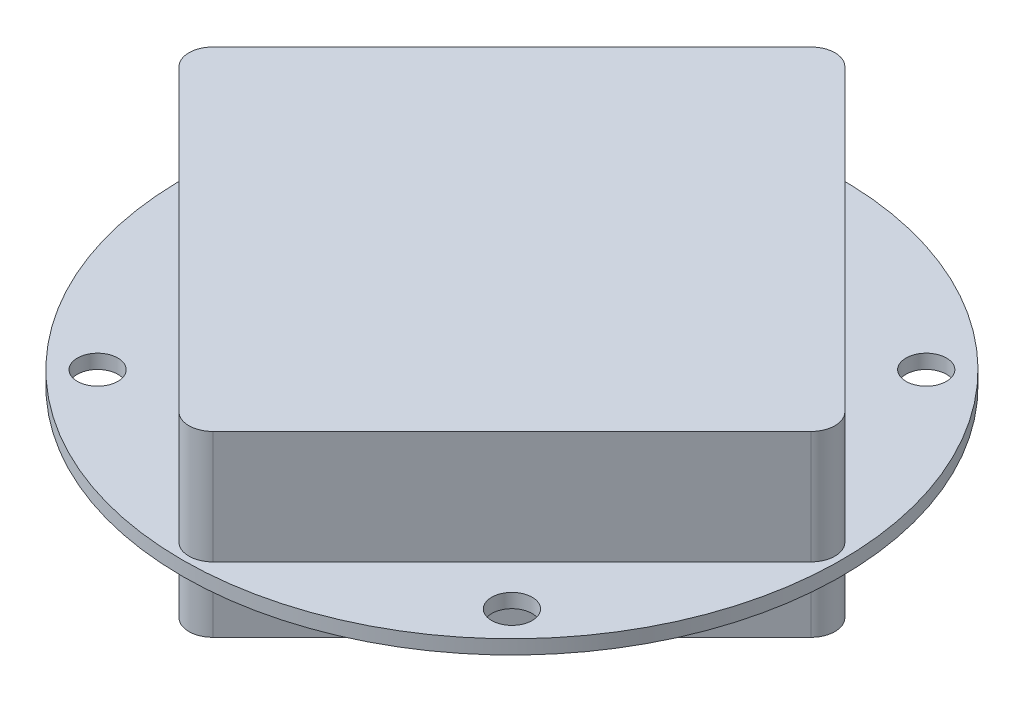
ISO-10303-21;
HEADER;
FILE_DESCRIPTION(('STEP AP214'),'2;1');
FILE_NAME('part.step','',(''),(''),'','','');
FILE_SCHEMA(('AUTOMOTIVE_DESIGN { 1 0 10303 214 1 1 1 1 }'));
ENDSEC;
DATA;
#1=APPLICATION_CONTEXT('core data for automotive mechanical design processes');
#2=APPLICATION_PROTOCOL_DEFINITION('international standard','automotive_design',2000,#1);
#3=PRODUCT_CONTEXT('',#1,'mechanical');
#4=PRODUCT('Part','Part','',(#3));
#5=PRODUCT_RELATED_PRODUCT_CATEGORY('part','',(#4));
#6=PRODUCT_DEFINITION_FORMATION('','',#4);
#7=PRODUCT_DEFINITION_CONTEXT('part definition',#1,'design');
#8=PRODUCT_DEFINITION('design','',#6,#7);
#9=PRODUCT_DEFINITION_SHAPE('','',#8);
#10=(LENGTH_UNIT() NAMED_UNIT(*) SI_UNIT(.MILLI.,.METRE.));
#11=(NAMED_UNIT(*) PLANE_ANGLE_UNIT() SI_UNIT($,.RADIAN.));
#12=(NAMED_UNIT(*) SI_UNIT($,.STERADIAN.) SOLID_ANGLE_UNIT());
#13=UNCERTAINTY_MEASURE_WITH_UNIT(LENGTH_MEASURE(1.E-05),#10,'distance_accuracy_value','');
#14=(GEOMETRIC_REPRESENTATION_CONTEXT(3) GLOBAL_UNCERTAINTY_ASSIGNED_CONTEXT((#13)) GLOBAL_UNIT_ASSIGNED_CONTEXT((#10,
#11,#12)) REPRESENTATION_CONTEXT('',''));
#15=CARTESIAN_POINT('',(0.,0.,0.));
#16=DIRECTION('',(0.,0.,1.));
#17=DIRECTION('',(1.,0.,0.));
#18=AXIS2_PLACEMENT_3D('',#15,#16,#17);
#19=CARTESIAN_POINT('',(0.,0.,0.));
#20=DIRECTION('',(0.,1.,0.));
#21=DIRECTION('',(0.,0.,1.));
#22=AXIS2_PLACEMENT_3D('',#19,#20,#21);
#23=PLANE('',#22);
#24=CARTESIAN_POINT('',(-10.9999999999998,0.,-11.0000000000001));
#25=DIRECTION('',(0.,1.,0.));
#26=DIRECTION('',(0.,0.,1.));
#27=AXIS2_PLACEMENT_3D('',#24,#25,#26);
#28=CIRCLE('',#27,1.075);
#29=CARTESIAN_POINT('',(-10.9999999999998,0.,-9.92500000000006));
#30=VERTEX_POINT('',#29);
#31=EDGE_CURVE('E323',#30,#30,#28,.T.);
#32=ORIENTED_EDGE('',*,*,#31,.T.);
#33=EDGE_LOOP('',(#32));
#34=FACE_BOUND('',#33,.T.);
#35=CARTESIAN_POINT('',(10.9999999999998,0.,-10.9999999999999));
#36=DIRECTION('',(0.,1.,0.));
#37=DIRECTION('',(0.,0.,1.));
#38=AXIS2_PLACEMENT_3D('',#35,#36,#37);
#39=CIRCLE('',#38,1.075);
#40=CARTESIAN_POINT('',(10.9999999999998,0.,-9.92499999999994));
#41=VERTEX_POINT('',#40);
#42=EDGE_CURVE('E317',#41,#41,#39,.T.);
#43=ORIENTED_EDGE('',*,*,#42,.T.);
#44=EDGE_LOOP('',(#43));
#45=FACE_BOUND('',#44,.T.);
#46=CARTESIAN_POINT('',(11.,0.,10.9999999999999));
#47=DIRECTION('',(0.,1.,0.));
#48=DIRECTION('',(0.,0.,1.));
#49=AXIS2_PLACEMENT_3D('',#46,#47,#48);
#50=CIRCLE('',#49,1.075);
#51=CARTESIAN_POINT('',(11.,0.,12.0749999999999));
#52=VERTEX_POINT('',#51);
#53=EDGE_CURVE('E311',#52,#52,#50,.T.);
#54=ORIENTED_EDGE('',*,*,#53,.T.);
#55=EDGE_LOOP('',(#54));
#56=FACE_BOUND('',#55,.T.);
#57=CARTESIAN_POINT('',(-11.,0.,10.9999999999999));
#58=DIRECTION('',(0.,1.,0.));
#59=DIRECTION('',(0.,0.,1.));
#60=AXIS2_PLACEMENT_3D('',#57,#58,#59);
#61=CIRCLE('',#60,1.075);
#62=CARTESIAN_POINT('',(-11.,0.,12.0749999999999));
#63=VERTEX_POINT('',#62);
#64=EDGE_CURVE('E243',#63,#63,#61,.T.);
#65=ORIENTED_EDGE('',*,*,#64,.T.);
#66=EDGE_LOOP('',(#65));
#67=FACE_BOUND('',#66,.T.);
#68=CARTESIAN_POINT('',(0.,0.,0.));
#69=DIRECTION('',(0.,1.,0.));
#70=DIRECTION('',(0.,0.,1.));
#71=AXIS2_PLACEMENT_3D('',#68,#69,#70);
#72=CIRCLE('',#71,17.5);
#73=CARTESIAN_POINT('',(0.,0.,17.5));
#74=VERTEX_POINT('',#73);
#75=EDGE_CURVE('E41',#74,#74,#72,.T.);
#76=ORIENTED_EDGE('',*,*,#75,.F.);
#77=EDGE_LOOP('',(#76));
#78=FACE_BOUND('',#77,.T.);
#79=CARTESIAN_POINT('',(0.,0.,-15.8816183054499));
#80=DIRECTION('',(0.,-1.,0.));
#81=DIRECTION('',(0.,0.,-1.));
#82=AXIS2_PLACEMENT_3D('',#79,#80,#81);
#83=CIRCLE('',#82,1.26999999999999);
#84=CARTESIAN_POINT('',(-0.898025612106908,0.,-16.7796439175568));
#85=VERTEX_POINT('',#84);
#86=CARTESIAN_POINT('',(0.898025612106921,0.,-16.7796439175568));
#87=VERTEX_POINT('',#86);
#88=EDGE_CURVE('E170',#85,#87,#83,.T.);
#89=ORIENTED_EDGE('',*,*,#88,.F.);
#90=DIRECTION('',(0.707106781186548,0.,-0.707106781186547));
#91=VECTOR('',#90,1.);
#92=CARTESIAN_POINT('',(-0.898025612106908,0.,-16.7796439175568));
#93=LINE('',#92,#91);
#94=CARTESIAN_POINT('',(-16.7796439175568,0.,-0.898025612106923));
#95=VERTEX_POINT('',#94);
#96=EDGE_CURVE('E167',#95,#85,#93,.T.);
#97=ORIENTED_EDGE('',*,*,#96,.F.);
#98=CARTESIAN_POINT('',(-15.8816183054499,0.,0.));
#99=DIRECTION('',(0.,-1.,0.));
#100=DIRECTION('',(0.,0.,-1.));
#101=AXIS2_PLACEMENT_3D('',#98,#99,#100);
#102=CIRCLE('',#101,1.27);
#103=CARTESIAN_POINT('',(-16.7796439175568,0.,0.898025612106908));
#104=VERTEX_POINT('',#103);
#105=EDGE_CURVE('E251',#104,#95,#102,.T.);
#106=ORIENTED_EDGE('',*,*,#105,.F.);
#107=DIRECTION('',(-0.707106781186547,0.,-0.707106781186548));
#108=VECTOR('',#107,1.);
#109=CARTESIAN_POINT('',(-16.7796439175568,0.,0.89802561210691));
#110=LINE('',#109,#108);
#111=CARTESIAN_POINT('',(-0.898025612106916,0.,16.7796439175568));
#112=VERTEX_POINT('',#111);
#113=EDGE_CURVE('E285',#112,#104,#110,.T.);
#114=ORIENTED_EDGE('',*,*,#113,.F.);
#115=CARTESIAN_POINT('',(0.,0.,15.8816183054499));
#116=DIRECTION('',(0.,-1.,0.));
#117=DIRECTION('',(0.,0.,-1.));
#118=AXIS2_PLACEMENT_3D('',#115,#116,#117);
#119=CIRCLE('',#118,1.27);
#120=CARTESIAN_POINT('',(0.898025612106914,0.,16.7796439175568));
#121=VERTEX_POINT('',#120);
#122=EDGE_CURVE('E279',#121,#112,#119,.T.);
#123=ORIENTED_EDGE('',*,*,#122,.F.);
#124=DIRECTION('',(-0.707106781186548,0.,0.707106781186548));
#125=VECTOR('',#124,1.);
#126=CARTESIAN_POINT('',(16.7796439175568,0.,0.898025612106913));
#127=LINE('',#126,#125);
#128=CARTESIAN_POINT('',(16.7796439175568,0.,0.898025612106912));
#129=VERTEX_POINT('',#128);
#130=EDGE_CURVE('E274',#129,#121,#127,.T.);
#131=ORIENTED_EDGE('',*,*,#130,.F.);
#132=CARTESIAN_POINT('',(15.8816183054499,0.,0.));
#133=DIRECTION('',(0.,-1.,0.));
#134=DIRECTION('',(0.,0.,-1.));
#135=AXIS2_PLACEMENT_3D('',#132,#133,#134);
#136=CIRCLE('',#135,1.27);
#137=CARTESIAN_POINT('',(16.7796439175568,0.,-0.898025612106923));
#138=VERTEX_POINT('',#137);
#139=EDGE_CURVE('E57',#138,#129,#136,.T.);
#140=ORIENTED_EDGE('',*,*,#139,.F.);
#141=DIRECTION('',(0.707106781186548,0.,0.707106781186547));
#142=VECTOR('',#141,1.);
#143=CARTESIAN_POINT('',(16.7796439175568,0.,-0.898025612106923));
#144=LINE('',#143,#142);
#145=EDGE_CURVE('E52',#87,#138,#144,.T.);
#146=ORIENTED_EDGE('',*,*,#145,.F.);
#147=EDGE_LOOP('',(#89,#97,#106,#114,#123,#131,#140,#146));
#148=FACE_BOUND('',#147,.T.);
#149=ADVANCED_FACE('F37',(#34,#45,#56,#67,#78,#148),#23,.F.);
#150=CARTESIAN_POINT('',(0.,0.75,0.));
#151=DIRECTION('',(0.,1.,0.));
#152=DIRECTION('',(0.,0.,1.));
#153=AXIS2_PLACEMENT_3D('',#150,#151,#152);
#154=PLANE('',#153);
#155=CARTESIAN_POINT('',(-10.9999999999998,0.75,-11.0000000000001));
#156=DIRECTION('',(0.,1.,0.));
#157=DIRECTION('',(0.,0.,1.));
#158=AXIS2_PLACEMENT_3D('',#155,#156,#157);
#159=CIRCLE('',#158,1.075);
#160=CARTESIAN_POINT('',(-10.9999999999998,0.75,-9.92500000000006));
#161=VERTEX_POINT('',#160);
#162=EDGE_CURVE('E326',#161,#161,#159,.T.);
#163=ORIENTED_EDGE('',*,*,#162,.F.);
#164=EDGE_LOOP('',(#163));
#165=FACE_BOUND('',#164,.T.);
#166=CARTESIAN_POINT('',(10.9999999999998,0.75,-10.9999999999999));
#167=DIRECTION('',(0.,1.,0.));
#168=DIRECTION('',(0.,0.,1.));
#169=AXIS2_PLACEMENT_3D('',#166,#167,#168);
#170=CIRCLE('',#169,1.075);
#171=CARTESIAN_POINT('',(10.9999999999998,0.75,-9.92499999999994));
#172=VERTEX_POINT('',#171);
#173=EDGE_CURVE('E320',#172,#172,#170,.T.);
#174=ORIENTED_EDGE('',*,*,#173,.F.);
#175=EDGE_LOOP('',(#174));
#176=FACE_BOUND('',#175,.T.);
#177=CARTESIAN_POINT('',(11.,0.75,10.9999999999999));
#178=DIRECTION('',(0.,1.,0.));
#179=DIRECTION('',(0.,0.,1.));
#180=AXIS2_PLACEMENT_3D('',#177,#178,#179);
#181=CIRCLE('',#180,1.075);
#182=CARTESIAN_POINT('',(11.,0.75,12.0749999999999));
#183=VERTEX_POINT('',#182);
#184=EDGE_CURVE('E314',#183,#183,#181,.T.);
#185=ORIENTED_EDGE('',*,*,#184,.F.);
#186=EDGE_LOOP('',(#185));
#187=FACE_BOUND('',#186,.T.);
#188=CARTESIAN_POINT('',(-11.,0.75,10.9999999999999));
#189=DIRECTION('',(0.,1.,0.));
#190=DIRECTION('',(0.,0.,1.));
#191=AXIS2_PLACEMENT_3D('',#188,#189,#190);
#192=CIRCLE('',#191,1.075);
#193=CARTESIAN_POINT('',(-11.,0.75,12.0749999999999));
#194=VERTEX_POINT('',#193);
#195=EDGE_CURVE('E308',#194,#194,#192,.T.);
#196=ORIENTED_EDGE('',*,*,#195,.F.);
#197=EDGE_LOOP('',(#196));
#198=FACE_BOUND('',#197,.T.);
#199=CARTESIAN_POINT('',(0.,0.75,0.));
#200=DIRECTION('',(0.,1.,0.));
#201=DIRECTION('',(0.,0.,1.));
#202=AXIS2_PLACEMENT_3D('',#199,#200,#201);
#203=CIRCLE('',#202,17.5);
#204=CARTESIAN_POINT('',(0.,0.75,17.5));
#205=VERTEX_POINT('',#204);
#206=EDGE_CURVE('E11',#205,#205,#203,.T.);
#207=ORIENTED_EDGE('',*,*,#206,.T.);
#208=EDGE_LOOP('',(#207));
#209=FACE_BOUND('',#208,.T.);
#210=DIRECTION('',(0.707106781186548,0.,0.707106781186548));
#211=VECTOR('',#210,1.);
#212=CARTESIAN_POINT('',(-16.7796439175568,0.75,0.898025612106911));
#213=LINE('',#212,#211);
#214=CARTESIAN_POINT('',(-16.7796439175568,0.75,0.898025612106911));
#215=VERTEX_POINT('',#214);
#216=CARTESIAN_POINT('',(-0.898025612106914,0.75,16.7796439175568));
#217=VERTEX_POINT('',#216);
#218=EDGE_CURVE('E174',#215,#217,#213,.T.);
#219=ORIENTED_EDGE('',*,*,#218,.F.);
#220=CARTESIAN_POINT('',(-15.8816183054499,0.75,0.));
#221=DIRECTION('',(0.,1.,0.));
#222=DIRECTION('',(0.,0.,-1.));
#223=AXIS2_PLACEMENT_3D('',#220,#221,#222);
#224=CIRCLE('',#223,1.27);
#225=CARTESIAN_POINT('',(-16.7796439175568,0.75,-0.898025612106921));
#226=VERTEX_POINT('',#225);
#227=EDGE_CURVE('E171',#226,#215,#224,.T.);
#228=ORIENTED_EDGE('',*,*,#227,.F.);
#229=DIRECTION('',(-0.707106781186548,0.,0.707106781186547));
#230=VECTOR('',#229,1.);
#231=CARTESIAN_POINT('',(-16.7796439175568,0.75,-0.898025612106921));
#232=LINE('',#231,#230);
#233=CARTESIAN_POINT('',(-0.898025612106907,0.75,-16.7796439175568));
#234=VERTEX_POINT('',#233);
#235=EDGE_CURVE('E184',#234,#226,#232,.T.);
#236=ORIENTED_EDGE('',*,*,#235,.F.);
#237=CARTESIAN_POINT('',(0.,0.75,-15.8816183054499));
#238=DIRECTION('',(0.,1.,0.));
#239=DIRECTION('',(0.,0.,-1.));
#240=AXIS2_PLACEMENT_3D('',#237,#238,#239);
#241=CIRCLE('',#240,1.27);
#242=CARTESIAN_POINT('',(0.898025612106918,0.75,-16.7796439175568));
#243=VERTEX_POINT('',#242);
#244=EDGE_CURVE('E208',#243,#234,#241,.T.);
#245=ORIENTED_EDGE('',*,*,#244,.F.);
#246=DIRECTION('',(-0.707106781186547,0.,-0.707106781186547));
#247=VECTOR('',#246,1.);
#248=CARTESIAN_POINT('',(0.898025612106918,0.75,-16.7796439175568));
#249=LINE('',#248,#247);
#250=CARTESIAN_POINT('',(16.7796439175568,0.75,-0.898025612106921));
#251=VERTEX_POINT('',#250);
#252=EDGE_CURVE('E206',#251,#243,#249,.T.);
#253=ORIENTED_EDGE('',*,*,#252,.F.);
#254=CARTESIAN_POINT('',(15.8816183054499,0.75,0.));
#255=DIRECTION('',(0.,1.,0.));
#256=DIRECTION('',(0.,0.,-1.));
#257=AXIS2_PLACEMENT_3D('',#254,#255,#256);
#258=CIRCLE('',#257,1.27);
#259=CARTESIAN_POINT('',(16.7796439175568,0.75,0.898025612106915));
#260=VERTEX_POINT('',#259);
#261=EDGE_CURVE('E204',#260,#251,#258,.T.);
#262=ORIENTED_EDGE('',*,*,#261,.F.);
#263=DIRECTION('',(0.707106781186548,0.,-0.707106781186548));
#264=VECTOR('',#263,1.);
#265=CARTESIAN_POINT('',(0.898025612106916,0.75,16.7796439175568));
#266=LINE('',#265,#264);
#267=CARTESIAN_POINT('',(0.898025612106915,0.75,16.7796439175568));
#268=VERTEX_POINT('',#267);
#269=EDGE_CURVE('E202',#268,#260,#266,.T.);
#270=ORIENTED_EDGE('',*,*,#269,.F.);
#271=CARTESIAN_POINT('',(0.,0.75,15.8816183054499));
#272=DIRECTION('',(0.,1.,0.));
#273=DIRECTION('',(0.,0.,1.));
#274=AXIS2_PLACEMENT_3D('',#271,#272,#273);
#275=CIRCLE('',#274,1.27);
#276=EDGE_CURVE('E200',#217,#268,#275,.T.);
#277=ORIENTED_EDGE('',*,*,#276,.F.);
#278=EDGE_LOOP('',(#219,#228,#236,#245,#253,#262,#270,#277));
#279=FACE_BOUND('',#278,.T.);
#280=ADVANCED_FACE('F239',(#165,#176,#187,#198,#209,#279),#154,.T.);
#281=CARTESIAN_POINT('',(0.,0.75,0.));
#282=DIRECTION('',(0.,-1.,0.));
#283=DIRECTION('',(0.,0.,-1.));
#284=AXIS2_PLACEMENT_3D('',#281,#282,#283);
#285=CYLINDRICAL_SURFACE('',#284,17.5);
#286=ORIENTED_EDGE('',*,*,#206,.F.);
#287=EDGE_LOOP('',(#286));
#288=FACE_BOUND('',#287,.T.);
#289=ORIENTED_EDGE('',*,*,#75,.T.);
#290=EDGE_LOOP('',(#289));
#291=FACE_BOUND('',#290,.T.);
#292=ADVANCED_FACE('F39',(#288,#291),#285,.T.);
#293=CARTESIAN_POINT('',(-15.8816183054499,6.75,0.));
#294=DIRECTION('',(0.,-1.,0.));
#295=DIRECTION('',(0.,0.,-1.));
#296=AXIS2_PLACEMENT_3D('',#293,#294,#295);
#297=CYLINDRICAL_SURFACE('',#296,1.27);
#298=ORIENTED_EDGE('',*,*,#227,.T.);
#299=DIRECTION('',(0.,-1.,0.));
#300=VECTOR('',#299,1.);
#301=CARTESIAN_POINT('',(-16.7796439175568,6.75,0.898025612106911));
#302=LINE('',#301,#300);
#303=CARTESIAN_POINT('',(-16.7796439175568,6.75,0.898025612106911));
#304=VERTEX_POINT('',#303);
#305=EDGE_CURVE('E231',#304,#215,#302,.T.);
#306=ORIENTED_EDGE('',*,*,#305,.F.);
#307=CARTESIAN_POINT('',(-15.8816183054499,6.75,0.));
#308=DIRECTION('',(0.,1.,0.));
#309=DIRECTION('',(0.,0.,-1.));
#310=AXIS2_PLACEMENT_3D('',#307,#308,#309);
#311=CIRCLE('',#310,1.27);
#312=CARTESIAN_POINT('',(-16.7796439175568,6.75,-0.898025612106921));
#313=VERTEX_POINT('',#312);
#314=EDGE_CURVE('E180',#313,#304,#311,.T.);
#315=ORIENTED_EDGE('',*,*,#314,.F.);
#316=DIRECTION('',(0.,-1.,0.));
#317=VECTOR('',#316,1.);
#318=CARTESIAN_POINT('',(-16.7796439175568,6.75,-0.898025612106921));
#319=LINE('',#318,#317);
#320=EDGE_CURVE('E197',#313,#226,#319,.T.);
#321=ORIENTED_EDGE('',*,*,#320,.T.);
#322=EDGE_LOOP('',(#298,#306,#315,#321));
#323=FACE_BOUND('',#322,.T.);
#324=ADVANCED_FACE('F363',(#323),#297,.T.);
#325=CARTESIAN_POINT('',(-16.7796439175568,6.75,0.898025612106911));
#326=DIRECTION('',(0.707106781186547,0.,-0.707106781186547));
#327=DIRECTION('',(-0.707106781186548,0.,-0.707106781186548));
#328=AXIS2_PLACEMENT_3D('',#325,#326,#327);
#329=PLANE('',#328);
#330=ORIENTED_EDGE('',*,*,#218,.T.);
#331=DIRECTION('',(0.,-1.,0.));
#332=VECTOR('',#331,1.);
#333=CARTESIAN_POINT('',(-0.898025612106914,6.75,16.7796439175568));
#334=LINE('',#333,#332);
#335=CARTESIAN_POINT('',(-0.898025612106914,6.75,16.7796439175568));
#336=VERTEX_POINT('',#335);
#337=EDGE_CURVE('E228',#336,#217,#334,.T.);
#338=ORIENTED_EDGE('',*,*,#337,.F.);
#339=DIRECTION('',(0.707106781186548,0.,0.707106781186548));
#340=VECTOR('',#339,1.);
#341=CARTESIAN_POINT('',(-16.7796439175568,6.75,0.898025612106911));
#342=LINE('',#341,#340);
#343=EDGE_CURVE('E183',#304,#336,#342,.T.);
#344=ORIENTED_EDGE('',*,*,#343,.F.);
#345=ORIENTED_EDGE('',*,*,#305,.T.);
#346=EDGE_LOOP('',(#330,#338,#344,#345));
#347=FACE_BOUND('',#346,.T.);
#348=ADVANCED_FACE('F350',(#347),#329,.F.);
#349=CARTESIAN_POINT('',(0.,6.75,15.8816183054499));
#350=DIRECTION('',(0.,-1.,0.));
#351=DIRECTION('',(0.,0.,-1.));
#352=AXIS2_PLACEMENT_3D('',#349,#350,#351);
#353=CYLINDRICAL_SURFACE('',#352,1.27);
#354=ORIENTED_EDGE('',*,*,#276,.T.);
#355=DIRECTION('',(0.,-1.,0.));
#356=VECTOR('',#355,1.);
#357=CARTESIAN_POINT('',(0.898025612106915,6.75,16.7796439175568));
#358=LINE('',#357,#356);
#359=CARTESIAN_POINT('',(0.898025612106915,6.75,16.7796439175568));
#360=VERTEX_POINT('',#359);
#361=EDGE_CURVE('E225',#360,#268,#358,.T.);
#362=ORIENTED_EDGE('',*,*,#361,.F.);
#363=CARTESIAN_POINT('',(0.,6.75,15.8816183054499));
#364=DIRECTION('',(0.,1.,0.));
#365=DIRECTION('',(0.,0.,1.));
#366=AXIS2_PLACEMENT_3D('',#363,#364,#365);
#367=CIRCLE('',#366,1.27);
#368=EDGE_CURVE('E186',#336,#360,#367,.T.);
#369=ORIENTED_EDGE('',*,*,#368,.F.);
#370=ORIENTED_EDGE('',*,*,#337,.T.);
#371=EDGE_LOOP('',(#354,#362,#369,#370));
#372=FACE_BOUND('',#371,.T.);
#373=ADVANCED_FACE('F353',(#372),#353,.T.);
#374=CARTESIAN_POINT('',(0.898025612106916,6.75,16.7796439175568));
#375=DIRECTION('',(-0.707106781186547,0.,-0.707106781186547));
#376=DIRECTION('',(-0.707106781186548,0.,0.707106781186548));
#377=AXIS2_PLACEMENT_3D('',#374,#375,#376);
#378=PLANE('',#377);
#379=ORIENTED_EDGE('',*,*,#269,.T.);
#380=DIRECTION('',(0.,-1.,0.));
#381=VECTOR('',#380,1.);
#382=CARTESIAN_POINT('',(16.7796439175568,6.75,0.898025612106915));
#383=LINE('',#382,#381);
#384=CARTESIAN_POINT('',(16.7796439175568,6.75,0.898025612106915));
#385=VERTEX_POINT('',#384);
#386=EDGE_CURVE('E222',#385,#260,#383,.T.);
#387=ORIENTED_EDGE('',*,*,#386,.F.);
#388=DIRECTION('',(0.707106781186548,0.,-0.707106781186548));
#389=VECTOR('',#388,1.);
#390=CARTESIAN_POINT('',(0.898025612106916,6.75,16.7796439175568));
#391=LINE('',#390,#389);
#392=EDGE_CURVE('E188',#360,#385,#391,.T.);
#393=ORIENTED_EDGE('',*,*,#392,.F.);
#394=ORIENTED_EDGE('',*,*,#361,.T.);
#395=EDGE_LOOP('',(#379,#387,#393,#394));
#396=FACE_BOUND('',#395,.T.);
#397=ADVANCED_FACE('F382',(#396),#378,.F.);
#398=CARTESIAN_POINT('',(15.8816183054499,6.75,0.));
#399=DIRECTION('',(0.,-1.,0.));
#400=DIRECTION('',(0.,0.,-1.));
#401=AXIS2_PLACEMENT_3D('',#398,#399,#400);
#402=CYLINDRICAL_SURFACE('',#401,1.27);
#403=ORIENTED_EDGE('',*,*,#261,.T.);
#404=DIRECTION('',(0.,-1.,0.));
#405=VECTOR('',#404,1.);
#406=CARTESIAN_POINT('',(16.7796439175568,6.75,-0.898025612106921));
#407=LINE('',#406,#405);
#408=CARTESIAN_POINT('',(16.7796439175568,6.75,-0.898025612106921));
#409=VERTEX_POINT('',#408);
#410=EDGE_CURVE('E219',#409,#251,#407,.T.);
#411=ORIENTED_EDGE('',*,*,#410,.F.);
#412=CARTESIAN_POINT('',(15.8816183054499,6.75,0.));
#413=DIRECTION('',(0.,1.,0.));
#414=DIRECTION('',(0.,0.,-1.));
#415=AXIS2_PLACEMENT_3D('',#412,#413,#414);
#416=CIRCLE('',#415,1.27);
#417=EDGE_CURVE('E190',#385,#409,#416,.T.);
#418=ORIENTED_EDGE('',*,*,#417,.F.);
#419=ORIENTED_EDGE('',*,*,#386,.T.);
#420=EDGE_LOOP('',(#403,#411,#418,#419));
#421=FACE_BOUND('',#420,.T.);
#422=ADVANCED_FACE('F380',(#421),#402,.T.);
#423=CARTESIAN_POINT('',(0.898025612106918,6.75,-16.7796439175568));
#424=DIRECTION('',(-0.707106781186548,0.,0.707106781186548));
#425=DIRECTION('',(0.707106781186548,0.,0.707106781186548));
#426=AXIS2_PLACEMENT_3D('',#423,#424,#425);
#427=PLANE('',#426);
#428=ORIENTED_EDGE('',*,*,#252,.T.);
#429=DIRECTION('',(0.,-1.,0.));
#430=VECTOR('',#429,1.);
#431=CARTESIAN_POINT('',(0.898025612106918,6.75,-16.7796439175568));
#432=LINE('',#431,#430);
#433=CARTESIAN_POINT('',(0.898025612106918,6.75,-16.7796439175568));
#434=VERTEX_POINT('',#433);
#435=EDGE_CURVE('E216',#434,#243,#432,.T.);
#436=ORIENTED_EDGE('',*,*,#435,.F.);
#437=DIRECTION('',(-0.707106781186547,0.,-0.707106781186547));
#438=VECTOR('',#437,1.);
#439=CARTESIAN_POINT('',(0.898025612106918,6.75,-16.7796439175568));
#440=LINE('',#439,#438);
#441=EDGE_CURVE('E192',#409,#434,#440,.T.);
#442=ORIENTED_EDGE('',*,*,#441,.F.);
#443=ORIENTED_EDGE('',*,*,#410,.T.);
#444=EDGE_LOOP('',(#428,#436,#442,#443));
#445=FACE_BOUND('',#444,.T.);
#446=ADVANCED_FACE('F376',(#445),#427,.F.);
#447=CARTESIAN_POINT('',(0.,6.75,-15.8816183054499));
#448=DIRECTION('',(0.,-1.,0.));
#449=DIRECTION('',(0.,0.,-1.));
#450=AXIS2_PLACEMENT_3D('',#447,#448,#449);
#451=CYLINDRICAL_SURFACE('',#450,1.27);
#452=ORIENTED_EDGE('',*,*,#244,.T.);
#453=DIRECTION('',(0.,-1.,0.));
#454=VECTOR('',#453,1.);
#455=CARTESIAN_POINT('',(-0.898025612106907,6.75,-16.7796439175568));
#456=LINE('',#455,#454);
#457=CARTESIAN_POINT('',(-0.898025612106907,6.75,-16.7796439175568));
#458=VERTEX_POINT('',#457);
#459=EDGE_CURVE('E214',#458,#234,#456,.T.);
#460=ORIENTED_EDGE('',*,*,#459,.F.);
#461=CARTESIAN_POINT('',(0.,6.75,-15.8816183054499));
#462=DIRECTION('',(0.,1.,0.));
#463=DIRECTION('',(0.,0.,-1.));
#464=AXIS2_PLACEMENT_3D('',#461,#462,#463);
#465=CIRCLE('',#464,1.27);
#466=EDGE_CURVE('E194',#434,#458,#465,.T.);
#467=ORIENTED_EDGE('',*,*,#466,.F.);
#468=ORIENTED_EDGE('',*,*,#435,.T.);
#469=EDGE_LOOP('',(#452,#460,#467,#468));
#470=FACE_BOUND('',#469,.T.);
#471=ADVANCED_FACE('F371',(#470),#451,.T.);
#472=CARTESIAN_POINT('',(-16.7796439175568,6.75,-0.898025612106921));
#473=DIRECTION('',(0.707106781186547,0.,0.707106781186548));
#474=DIRECTION('',(0.707106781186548,0.,-0.707106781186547));
#475=AXIS2_PLACEMENT_3D('',#472,#473,#474);
#476=PLANE('',#475);
#477=ORIENTED_EDGE('',*,*,#235,.T.);
#478=ORIENTED_EDGE('',*,*,#320,.F.);
#479=DIRECTION('',(-0.707106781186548,0.,0.707106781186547));
#480=VECTOR('',#479,1.);
#481=CARTESIAN_POINT('',(-16.7796439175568,6.75,-0.898025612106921));
#482=LINE('',#481,#480);
#483=EDGE_CURVE('E196',#458,#313,#482,.T.);
#484=ORIENTED_EDGE('',*,*,#483,.F.);
#485=ORIENTED_EDGE('',*,*,#459,.T.);
#486=EDGE_LOOP('',(#477,#478,#484,#485));
#487=FACE_BOUND('',#486,.T.);
#488=ADVANCED_FACE('F365',(#487),#476,.F.);
#489=CARTESIAN_POINT('',(-15.8816183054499,6.75,0.));
#490=DIRECTION('',(0.,-1.,0.));
#491=DIRECTION('',(0.,0.,-1.));
#492=AXIS2_PLACEMENT_3D('',#489,#490,#491);
#493=PLANE('',#492);
#494=ORIENTED_EDGE('',*,*,#314,.T.);
#495=ORIENTED_EDGE('',*,*,#343,.T.);
#496=ORIENTED_EDGE('',*,*,#368,.T.);
#497=ORIENTED_EDGE('',*,*,#392,.T.);
#498=ORIENTED_EDGE('',*,*,#417,.T.);
#499=ORIENTED_EDGE('',*,*,#441,.T.);
#500=ORIENTED_EDGE('',*,*,#466,.T.);
#501=ORIENTED_EDGE('',*,*,#483,.T.);
#502=EDGE_LOOP('',(#494,#495,#496,#497,#498,#499,#500,#501));
#503=FACE_BOUND('',#502,.T.);
#504=ADVANCED_FACE('F357',(#503),#493,.F.);
#505=CARTESIAN_POINT('',(0.,-2.72,-15.8816183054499));
#506=DIRECTION('',(0.,1.,0.));
#507=DIRECTION('',(0.,0.,1.));
#508=AXIS2_PLACEMENT_3D('',#505,#506,#507);
#509=CYLINDRICAL_SURFACE('',#508,1.26999999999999);
#510=ORIENTED_EDGE('',*,*,#88,.T.);
#511=DIRECTION('',(0.,1.,0.));
#512=VECTOR('',#511,1.);
#513=CARTESIAN_POINT('',(0.898025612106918,-2.72,-16.7796439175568));
#514=LINE('',#513,#512);
#515=CARTESIAN_POINT('',(0.898025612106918,-2.72,-16.7796439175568));
#516=VERTEX_POINT('',#515);
#517=EDGE_CURVE('E151',#516,#87,#514,.T.);
#518=ORIENTED_EDGE('',*,*,#517,.F.);
#519=CARTESIAN_POINT('',(0.,-2.72,-15.8816183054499));
#520=DIRECTION('',(0.,-1.,0.));
#521=DIRECTION('',(0.,0.,-1.));
#522=AXIS2_PLACEMENT_3D('',#519,#520,#521);
#523=CIRCLE('',#522,1.26999999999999);
#524=CARTESIAN_POINT('',(-0.898025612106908,-2.72,-16.7796439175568));
#525=VERTEX_POINT('',#524);
#526=EDGE_CURVE('E158',#525,#516,#523,.T.);
#527=ORIENTED_EDGE('',*,*,#526,.F.);
#528=DIRECTION('',(0.,1.,0.));
#529=VECTOR('',#528,1.);
#530=CARTESIAN_POINT('',(-0.898025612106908,-2.72,-16.7796439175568));
#531=LINE('',#530,#529);
#532=EDGE_CURVE('E248',#525,#85,#531,.T.);
#533=ORIENTED_EDGE('',*,*,#532,.T.);
#534=EDGE_LOOP('',(#510,#518,#527,#533));
#535=FACE_BOUND('',#534,.T.);
#536=ADVANCED_FACE('F169',(#535),#509,.T.);
#537=CARTESIAN_POINT('',(16.7796439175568,-2.72,-0.898025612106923));
#538=DIRECTION('',(-0.707106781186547,0.,0.707106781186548));
#539=DIRECTION('',(0.707106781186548,0.,0.707106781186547));
#540=AXIS2_PLACEMENT_3D('',#537,#538,#539);
#541=PLANE('',#540);
#542=ORIENTED_EDGE('',*,*,#145,.T.);
#543=DIRECTION('',(0.,1.,0.));
#544=VECTOR('',#543,1.);
#545=CARTESIAN_POINT('',(16.7796439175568,-2.72,-0.898025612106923));
#546=LINE('',#545,#544);
#547=CARTESIAN_POINT('',(16.7796439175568,-2.72,-0.898025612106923));
#548=VERTEX_POINT('',#547);
#549=EDGE_CURVE('E154',#548,#138,#546,.T.);
#550=ORIENTED_EDGE('',*,*,#549,.F.);
#551=DIRECTION('',(0.707106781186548,0.,0.707106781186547));
#552=VECTOR('',#551,1.);
#553=CARTESIAN_POINT('',(16.7796439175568,-2.72,-0.898025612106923));
#554=LINE('',#553,#552);
#555=EDGE_CURVE('E147',#516,#548,#554,.T.);
#556=ORIENTED_EDGE('',*,*,#555,.F.);
#557=ORIENTED_EDGE('',*,*,#517,.T.);
#558=EDGE_LOOP('',(#542,#550,#556,#557));
#559=FACE_BOUND('',#558,.T.);
#560=ADVANCED_FACE('F149',(#559),#541,.F.);
#561=CARTESIAN_POINT('',(15.8816183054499,-2.72,0.));
#562=DIRECTION('',(0.,1.,0.));
#563=DIRECTION('',(0.,0.,1.));
#564=AXIS2_PLACEMENT_3D('',#561,#562,#563);
#565=CYLINDRICAL_SURFACE('',#564,1.27);
#566=ORIENTED_EDGE('',*,*,#139,.T.);
#567=DIRECTION('',(0.,1.,0.));
#568=VECTOR('',#567,1.);
#569=CARTESIAN_POINT('',(16.7796439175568,-2.72,0.898025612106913));
#570=LINE('',#569,#568);
#571=CARTESIAN_POINT('',(16.7796439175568,-2.72,0.898025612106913));
#572=VERTEX_POINT('',#571);
#573=EDGE_CURVE('E176',#572,#129,#570,.T.);
#574=ORIENTED_EDGE('',*,*,#573,.F.);
#575=CARTESIAN_POINT('',(15.8816183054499,-2.72,0.));
#576=DIRECTION('',(0.,-1.,0.));
#577=DIRECTION('',(0.,0.,-1.));
#578=AXIS2_PLACEMENT_3D('',#575,#576,#577);
#579=CIRCLE('',#578,1.27);
#580=EDGE_CURVE('E157',#548,#572,#579,.T.);
#581=ORIENTED_EDGE('',*,*,#580,.F.);
#582=ORIENTED_EDGE('',*,*,#549,.T.);
#583=EDGE_LOOP('',(#566,#574,#581,#582));
#584=FACE_BOUND('',#583,.T.);
#585=ADVANCED_FACE('F277',(#584),#565,.T.);
#586=CARTESIAN_POINT('',(16.7796439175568,-2.72,0.898025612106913));
#587=DIRECTION('',(-0.707106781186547,0.,-0.707106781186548));
#588=DIRECTION('',(-0.707106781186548,0.,0.707106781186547));
#589=AXIS2_PLACEMENT_3D('',#586,#587,#588);
#590=PLANE('',#589);
#591=ORIENTED_EDGE('',*,*,#130,.T.);
#592=DIRECTION('',(0.,1.,0.));
#593=VECTOR('',#592,1.);
#594=CARTESIAN_POINT('',(0.898025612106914,-2.72,16.7796439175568));
#595=LINE('',#594,#593);
#596=CARTESIAN_POINT('',(0.898025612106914,-2.72,16.7796439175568));
#597=VERTEX_POINT('',#596);
#598=EDGE_CURVE('E265',#597,#121,#595,.T.);
#599=ORIENTED_EDGE('',*,*,#598,.F.);
#600=DIRECTION('',(-0.707106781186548,0.,0.707106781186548));
#601=VECTOR('',#600,1.);
#602=CARTESIAN_POINT('',(16.7796439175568,-2.72,0.898025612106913));
#603=LINE('',#602,#601);
#604=EDGE_CURVE('E275',#572,#597,#603,.T.);
#605=ORIENTED_EDGE('',*,*,#604,.F.);
#606=ORIENTED_EDGE('',*,*,#573,.T.);
#607=EDGE_LOOP('',(#591,#599,#605,#606));
#608=FACE_BOUND('',#607,.T.);
#609=ADVANCED_FACE('F272',(#608),#590,.F.);
#610=CARTESIAN_POINT('',(0.,-2.72,15.8816183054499));
#611=DIRECTION('',(0.,1.,0.));
#612=DIRECTION('',(0.,0.,1.));
#613=AXIS2_PLACEMENT_3D('',#610,#611,#612);
#614=CYLINDRICAL_SURFACE('',#613,1.27);
#615=ORIENTED_EDGE('',*,*,#122,.T.);
#616=DIRECTION('',(0.,1.,0.));
#617=VECTOR('',#616,1.);
#618=CARTESIAN_POINT('',(-0.898025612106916,-2.72,16.7796439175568));
#619=LINE('',#618,#617);
#620=CARTESIAN_POINT('',(-0.898025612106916,-2.72,16.7796439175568));
#621=VERTEX_POINT('',#620);
#622=EDGE_CURVE('E262',#621,#112,#619,.T.);
#623=ORIENTED_EDGE('',*,*,#622,.F.);
#624=CARTESIAN_POINT('',(0.,-2.72,15.8816183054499));
#625=DIRECTION('',(0.,-1.,0.));
#626=DIRECTION('',(0.,0.,-1.));
#627=AXIS2_PLACEMENT_3D('',#624,#625,#626);
#628=CIRCLE('',#627,1.27);
#629=EDGE_CURVE('E299',#597,#621,#628,.T.);
#630=ORIENTED_EDGE('',*,*,#629,.F.);
#631=ORIENTED_EDGE('',*,*,#598,.T.);
#632=EDGE_LOOP('',(#615,#623,#630,#631));
#633=FACE_BOUND('',#632,.T.);
#634=ADVANCED_FACE('F298',(#633),#614,.T.);
#635=CARTESIAN_POINT('',(-16.7796439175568,-2.72,0.89802561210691));
#636=DIRECTION('',(0.707106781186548,0.,-0.707106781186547));
#637=DIRECTION('',(-0.707106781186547,0.,-0.707106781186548));
#638=AXIS2_PLACEMENT_3D('',#635,#636,#637);
#639=PLANE('',#638);
#640=ORIENTED_EDGE('',*,*,#113,.T.);
#641=DIRECTION('',(0.,1.,0.));
#642=VECTOR('',#641,1.);
#643=CARTESIAN_POINT('',(-16.7796439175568,-2.72,0.898025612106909));
#644=LINE('',#643,#642);
#645=CARTESIAN_POINT('',(-16.7796439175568,-2.72,0.898025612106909));
#646=VERTEX_POINT('',#645);
#647=EDGE_CURVE('E254',#646,#104,#644,.T.);
#648=ORIENTED_EDGE('',*,*,#647,.F.);
#649=DIRECTION('',(-0.707106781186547,0.,-0.707106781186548));
#650=VECTOR('',#649,1.);
#651=CARTESIAN_POINT('',(-16.7796439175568,-2.72,0.89802561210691));
#652=LINE('',#651,#650);
#653=EDGE_CURVE('E295',#621,#646,#652,.T.);
#654=ORIENTED_EDGE('',*,*,#653,.F.);
#655=ORIENTED_EDGE('',*,*,#622,.T.);
#656=EDGE_LOOP('',(#640,#648,#654,#655));
#657=FACE_BOUND('',#656,.T.);
#658=ADVANCED_FACE('F292',(#657),#639,.F.);
#659=CARTESIAN_POINT('',(-15.8816183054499,-2.72,0.));
#660=DIRECTION('',(0.,1.,0.));
#661=DIRECTION('',(0.,0.,1.));
#662=AXIS2_PLACEMENT_3D('',#659,#660,#661);
#663=CYLINDRICAL_SURFACE('',#662,1.27);
#664=ORIENTED_EDGE('',*,*,#105,.T.);
#665=DIRECTION('',(0.,1.,0.));
#666=VECTOR('',#665,1.);
#667=CARTESIAN_POINT('',(-16.7796439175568,-2.72,-0.898025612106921));
#668=LINE('',#667,#666);
#669=CARTESIAN_POINT('',(-16.7796439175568,-2.72,-0.898025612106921));
#670=VERTEX_POINT('',#669);
#671=EDGE_CURVE('E250',#670,#95,#668,.T.);
#672=ORIENTED_EDGE('',*,*,#671,.F.);
#673=CARTESIAN_POINT('',(-15.8816183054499,-2.72,0.));
#674=DIRECTION('',(0.,-1.,0.));
#675=DIRECTION('',(0.,0.,-1.));
#676=AXIS2_PLACEMENT_3D('',#673,#674,#675);
#677=CIRCLE('',#676,1.27);
#678=EDGE_CURVE('E256',#646,#670,#677,.T.);
#679=ORIENTED_EDGE('',*,*,#678,.F.);
#680=ORIENTED_EDGE('',*,*,#647,.T.);
#681=EDGE_LOOP('',(#664,#672,#679,#680));
#682=FACE_BOUND('',#681,.T.);
#683=ADVANCED_FACE('F288',(#682),#663,.T.);
#684=CARTESIAN_POINT('',(-0.898025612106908,-2.72,-16.7796439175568));
#685=DIRECTION('',(0.707106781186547,0.,0.707106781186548));
#686=DIRECTION('',(0.707106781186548,0.,-0.707106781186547));
#687=AXIS2_PLACEMENT_3D('',#684,#685,#686);
#688=PLANE('',#687);
#689=ORIENTED_EDGE('',*,*,#96,.T.);
#690=ORIENTED_EDGE('',*,*,#532,.F.);
#691=DIRECTION('',(0.707106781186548,0.,-0.707106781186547));
#692=VECTOR('',#691,1.);
#693=CARTESIAN_POINT('',(-0.898025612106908,-2.72,-16.7796439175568));
#694=LINE('',#693,#692);
#695=EDGE_CURVE('E163',#670,#525,#694,.T.);
#696=ORIENTED_EDGE('',*,*,#695,.F.);
#697=ORIENTED_EDGE('',*,*,#671,.T.);
#698=EDGE_LOOP('',(#689,#690,#696,#697));
#699=FACE_BOUND('',#698,.T.);
#700=ADVANCED_FACE('F247',(#699),#688,.F.);
#701=CARTESIAN_POINT('',(0.,-2.72,-15.8816183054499));
#702=DIRECTION('',(0.,-1.,0.));
#703=DIRECTION('',(0.,0.,-1.));
#704=AXIS2_PLACEMENT_3D('',#701,#702,#703);
#705=PLANE('',#704);
#706=ORIENTED_EDGE('',*,*,#526,.T.);
#707=ORIENTED_EDGE('',*,*,#555,.T.);
#708=ORIENTED_EDGE('',*,*,#580,.T.);
#709=ORIENTED_EDGE('',*,*,#604,.T.);
#710=ORIENTED_EDGE('',*,*,#629,.T.);
#711=ORIENTED_EDGE('',*,*,#653,.T.);
#712=ORIENTED_EDGE('',*,*,#678,.T.);
#713=ORIENTED_EDGE('',*,*,#695,.T.);
#714=EDGE_LOOP('',(#706,#707,#708,#709,#710,#711,#712,#713));
#715=FACE_BOUND('',#714,.T.);
#716=ADVANCED_FACE('F161',(#715),#705,.T.);
#717=CARTESIAN_POINT('',(-11.,0.75,10.9999999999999));
#718=DIRECTION('',(0.,1.,0.));
#719=DIRECTION('',(0.,0.,1.));
#720=AXIS2_PLACEMENT_3D('',#717,#718,#719);
#721=CYLINDRICAL_SURFACE('',#720,1.075);
#722=ORIENTED_EDGE('',*,*,#195,.T.);
#723=EDGE_LOOP('',(#722));
#724=FACE_BOUND('',#723,.T.);
#725=ORIENTED_EDGE('',*,*,#64,.F.);
#726=EDGE_LOOP('',(#725));
#727=FACE_BOUND('',#726,.T.);
#728=ADVANCED_FACE('F423',(#724,#727),#721,.F.);
#729=CARTESIAN_POINT('',(11.,0.75,10.9999999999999));
#730=DIRECTION('',(0.,1.,0.));
#731=DIRECTION('',(0.,0.,1.));
#732=AXIS2_PLACEMENT_3D('',#729,#730,#731);
#733=CYLINDRICAL_SURFACE('',#732,1.075);
#734=ORIENTED_EDGE('',*,*,#184,.T.);
#735=EDGE_LOOP('',(#734));
#736=FACE_BOUND('',#735,.T.);
#737=ORIENTED_EDGE('',*,*,#53,.F.);
#738=EDGE_LOOP('',(#737));
#739=FACE_BOUND('',#738,.T.);
#740=ADVANCED_FACE('F553',(#736,#739),#733,.F.);
#741=CARTESIAN_POINT('',(10.9999999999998,0.75,-10.9999999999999));
#742=DIRECTION('',(0.,1.,0.));
#743=DIRECTION('',(0.,0.,1.));
#744=AXIS2_PLACEMENT_3D('',#741,#742,#743);
#745=CYLINDRICAL_SURFACE('',#744,1.075);
#746=ORIENTED_EDGE('',*,*,#173,.T.);
#747=EDGE_LOOP('',(#746));
#748=FACE_BOUND('',#747,.T.);
#749=ORIENTED_EDGE('',*,*,#42,.F.);
#750=EDGE_LOOP('',(#749));
#751=FACE_BOUND('',#750,.T.);
#752=ADVANCED_FACE('F557',(#748,#751),#745,.F.);
#753=CARTESIAN_POINT('',(-10.9999999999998,0.75,-11.0000000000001));
#754=DIRECTION('',(0.,1.,0.));
#755=DIRECTION('',(0.,0.,1.));
#756=AXIS2_PLACEMENT_3D('',#753,#754,#755);
#757=CYLINDRICAL_SURFACE('',#756,1.075);
#758=ORIENTED_EDGE('',*,*,#162,.T.);
#759=EDGE_LOOP('',(#758));
#760=FACE_BOUND('',#759,.T.);
#761=ORIENTED_EDGE('',*,*,#31,.F.);
#762=EDGE_LOOP('',(#761));
#763=FACE_BOUND('',#762,.T.);
#764=ADVANCED_FACE('F330',(#760,#763),#757,.F.);
#765=CLOSED_SHELL('',(#149,#280,#292,#324,#348,#373,#397,#422,#446,#471,#488,#504,#536,#560,
#585,#609,#634,#658,#683,#700,#716,#728,#740,#752,#764));
#766=MANIFOLD_SOLID_BREP('B2',#765);
#767=ADVANCED_BREP_SHAPE_REPRESENTATION('',(#18,#766),#14);
#768=SHAPE_DEFINITION_REPRESENTATION(#9,#767);
ENDSEC;
END-ISO-10303-21;
